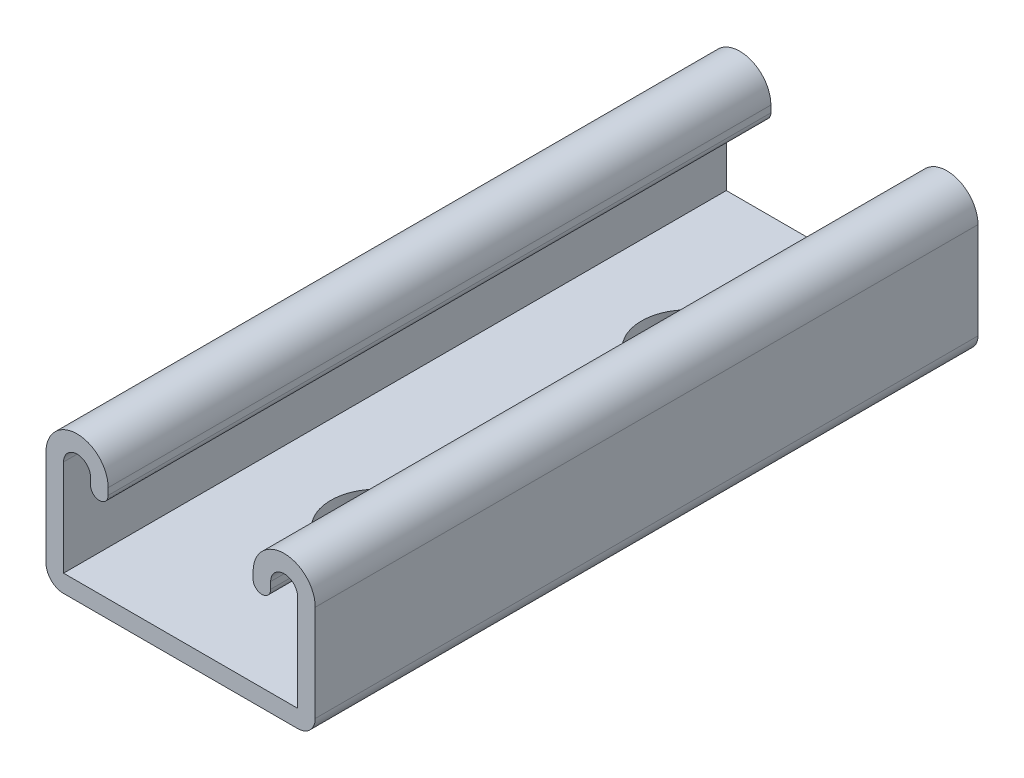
ISO-10303-21;
HEADER;
FILE_DESCRIPTION(('STEP AP214'),'2;1');
FILE_NAME('part.step','',(''),(''),'','','');
FILE_SCHEMA(('AUTOMOTIVE_DESIGN { 1 0 10303 214 1 1 1 1 }'));
ENDSEC;
DATA;
#1=APPLICATION_CONTEXT('core data for automotive mechanical design processes');
#2=APPLICATION_PROTOCOL_DEFINITION('international standard','automotive_design',2000,#1);
#3=PRODUCT_CONTEXT('',#1,'mechanical');
#4=PRODUCT('Part','Part','',(#3));
#5=PRODUCT_RELATED_PRODUCT_CATEGORY('part','',(#4));
#6=PRODUCT_DEFINITION_FORMATION('','',#4);
#7=PRODUCT_DEFINITION_CONTEXT('part definition',#1,'design');
#8=PRODUCT_DEFINITION('design','',#6,#7);
#9=PRODUCT_DEFINITION_SHAPE('','',#8);
#10=(LENGTH_UNIT() NAMED_UNIT(*) SI_UNIT(.MILLI.,.METRE.));
#11=(NAMED_UNIT(*) PLANE_ANGLE_UNIT() SI_UNIT($,.RADIAN.));
#12=(NAMED_UNIT(*) SI_UNIT($,.STERADIAN.) SOLID_ANGLE_UNIT());
#13=UNCERTAINTY_MEASURE_WITH_UNIT(LENGTH_MEASURE(1.E-05),#10,'distance_accuracy_value','');
#14=(GEOMETRIC_REPRESENTATION_CONTEXT(3) GLOBAL_UNCERTAINTY_ASSIGNED_CONTEXT((#13)) GLOBAL_UNIT_ASSIGNED_CONTEXT((#10,
#11,#12)) REPRESENTATION_CONTEXT('',''));
#15=CARTESIAN_POINT('',(0.,0.,0.));
#16=DIRECTION('',(0.,0.,1.));
#17=DIRECTION('',(1.,0.,0.));
#18=AXIS2_PLACEMENT_3D('',#15,#16,#17);
#19=CARTESIAN_POINT('',(-15.875,8.3693,101.6));
#20=DIRECTION('',(0.,0.,-1.));
#21=DIRECTION('',(-1.,0.,0.));
#22=AXIS2_PLACEMENT_3D('',#19,#20,#21);
#23=CYLINDRICAL_SURFACE('',#22,4.7625);
#24=CARTESIAN_POINT('',(-15.875,8.3693,0.));
#25=DIRECTION('',(0.,0.,1.));
#26=DIRECTION('',(-1.,0.,0.));
#27=AXIS2_PLACEMENT_3D('',#24,#25,#26);
#28=CIRCLE('',#27,4.7625);
#29=CARTESIAN_POINT('',(-11.1125,8.3693,0.));
#30=VERTEX_POINT('',#29);
#31=CARTESIAN_POINT('',(-20.6375,8.3693,0.));
#32=VERTEX_POINT('',#31);
#33=EDGE_CURVE('E207',#30,#32,#28,.T.);
#34=ORIENTED_EDGE('',*,*,#33,.T.);
#35=DIRECTION('',(0.,0.,-1.));
#36=VECTOR('',#35,1.);
#37=CARTESIAN_POINT('',(-20.6375,8.3693,101.6));
#38=LINE('',#37,#36);
#39=CARTESIAN_POINT('',(-20.6375,8.3693,101.6));
#40=VERTEX_POINT('',#39);
#41=EDGE_CURVE('E11',#40,#32,#38,.T.);
#42=ORIENTED_EDGE('',*,*,#41,.F.);
#43=CARTESIAN_POINT('',(-15.875,8.3693,101.6));
#44=DIRECTION('',(0.,0.,1.));
#45=DIRECTION('',(-1.,0.,0.));
#46=AXIS2_PLACEMENT_3D('',#43,#44,#45);
#47=CIRCLE('',#46,4.7625);
#48=CARTESIAN_POINT('',(-11.1125,8.3693,101.6));
#49=VERTEX_POINT('',#48);
#50=EDGE_CURVE('E260',#49,#40,#47,.T.);
#51=ORIENTED_EDGE('',*,*,#50,.F.);
#52=DIRECTION('',(0.,0.,-1.));
#53=VECTOR('',#52,1.);
#54=CARTESIAN_POINT('',(-11.1125,8.3693,101.6));
#55=LINE('',#54,#53);
#56=EDGE_CURVE('E204',#49,#30,#55,.T.);
#57=ORIENTED_EDGE('',*,*,#56,.T.);
#58=EDGE_LOOP('',(#34,#42,#51,#57));
#59=FACE_BOUND('',#58,.T.);
#60=ADVANCED_FACE('F41',(#59),#23,.T.);
#61=CARTESIAN_POINT('',(-20.6375,8.3693,101.6));
#62=DIRECTION('',(1.,0.,0.));
#63=DIRECTION('',(0.,1.,0.));
#64=AXIS2_PLACEMENT_3D('',#61,#62,#63);
#65=PLANE('',#64);
#66=DIRECTION('',(0.,-1.,0.));
#67=VECTOR('',#66,1.);
#68=CARTESIAN_POINT('',(-20.6375,8.3693,0.));
#69=LINE('',#68,#67);
#70=CARTESIAN_POINT('',(-20.6375,-6.4008,0.));
#71=VERTEX_POINT('',#70);
#72=EDGE_CURVE('E208',#32,#71,#69,.T.);
#73=ORIENTED_EDGE('',*,*,#72,.T.);
#74=DIRECTION('',(0.,0.,-1.));
#75=VECTOR('',#74,1.);
#76=CARTESIAN_POINT('',(-20.6375,-6.4008,101.6));
#77=LINE('',#76,#75);
#78=CARTESIAN_POINT('',(-20.6375,-6.4008,101.6));
#79=VERTEX_POINT('',#78);
#80=EDGE_CURVE('E51',#79,#71,#77,.T.);
#81=ORIENTED_EDGE('',*,*,#80,.F.);
#82=DIRECTION('',(0.,-1.,0.));
#83=VECTOR('',#82,1.);
#84=CARTESIAN_POINT('',(-20.6375,8.3693,101.6));
#85=LINE('',#84,#83);
#86=EDGE_CURVE('E135',#40,#79,#85,.T.);
#87=ORIENTED_EDGE('',*,*,#86,.F.);
#88=ORIENTED_EDGE('',*,*,#41,.T.);
#89=EDGE_LOOP('',(#73,#81,#87,#88));
#90=FACE_BOUND('',#89,.T.);
#91=ADVANCED_FACE('F431',(#90),#65,.F.);
#92=CARTESIAN_POINT('',(-17.9451,-6.4008,101.6));
#93=DIRECTION('',(0.,0.,-1.));
#94=DIRECTION('',(-1.,0.,0.));
#95=AXIS2_PLACEMENT_3D('',#92,#93,#94);
#96=CYLINDRICAL_SURFACE('',#95,2.6924);
#97=CARTESIAN_POINT('',(-17.9451,-6.4008,0.));
#98=DIRECTION('',(0.,0.,1.));
#99=DIRECTION('',(-1.,0.,0.));
#100=AXIS2_PLACEMENT_3D('',#97,#98,#99);
#101=CIRCLE('',#100,2.6924);
#102=CARTESIAN_POINT('',(-17.9451,-9.0932,0.));
#103=VERTEX_POINT('',#102);
#104=EDGE_CURVE('E212',#71,#103,#101,.T.);
#105=ORIENTED_EDGE('',*,*,#104,.T.);
#106=DIRECTION('',(0.,0.,-1.));
#107=VECTOR('',#106,1.);
#108=CARTESIAN_POINT('',(-17.9451,-9.0932,101.6));
#109=LINE('',#108,#107);
#110=CARTESIAN_POINT('',(-17.9451,-9.0932,101.6));
#111=VERTEX_POINT('',#110);
#112=EDGE_CURVE('E310',#111,#103,#109,.T.);
#113=ORIENTED_EDGE('',*,*,#112,.F.);
#114=CARTESIAN_POINT('',(-17.9451,-6.4008,101.6));
#115=DIRECTION('',(0.,0.,1.));
#116=DIRECTION('',(-1.,0.,0.));
#117=AXIS2_PLACEMENT_3D('',#114,#115,#116);
#118=CIRCLE('',#117,2.6924);
#119=EDGE_CURVE('E318',#79,#111,#118,.T.);
#120=ORIENTED_EDGE('',*,*,#119,.F.);
#121=ORIENTED_EDGE('',*,*,#80,.T.);
#122=EDGE_LOOP('',(#105,#113,#120,#121));
#123=FACE_BOUND('',#122,.T.);
#124=ADVANCED_FACE('F319',(#123),#96,.T.);
#125=CARTESIAN_POINT('',(-17.9451,-9.0932,101.6));
#126=DIRECTION('',(0.,1.,0.));
#127=DIRECTION('',(0.,0.,1.));
#128=AXIS2_PLACEMENT_3D('',#125,#126,#127);
#129=PLANE('',#128);
#130=CARTESIAN_POINT('',(0.,-9.0932,71.4375));
#131=DIRECTION('',(0.,-1.,0.));
#132=DIRECTION('',(0.,0.,-1.));
#133=AXIS2_PLACEMENT_3D('',#130,#131,#132);
#134=CIRCLE('',#133,7.14375);
#135=CARTESIAN_POINT('',(0.,-9.0932,64.29375));
#136=VERTEX_POINT('',#135);
#137=EDGE_CURVE('E619',#136,#136,#134,.T.);
#138=ORIENTED_EDGE('',*,*,#137,.F.);
#139=EDGE_LOOP('',(#138));
#140=FACE_BOUND('',#139,.T.);
#141=CARTESIAN_POINT('',(0.,-9.0932,23.8125));
#142=DIRECTION('',(0.,-1.,0.));
#143=DIRECTION('',(0.,0.,-1.));
#144=AXIS2_PLACEMENT_3D('',#141,#142,#143);
#145=CIRCLE('',#144,7.14375);
#146=CARTESIAN_POINT('',(0.,-9.0932,16.66875));
#147=VERTEX_POINT('',#146);
#148=EDGE_CURVE('E622',#147,#147,#145,.T.);
#149=ORIENTED_EDGE('',*,*,#148,.F.);
#150=EDGE_LOOP('',(#149));
#151=FACE_BOUND('',#150,.T.);
#152=DIRECTION('',(1.,0.,0.));
#153=VECTOR('',#152,1.);
#154=CARTESIAN_POINT('',(-17.9451,-9.0932,0.));
#155=LINE('',#154,#153);
#156=CARTESIAN_POINT('',(17.9451,-9.0932,0.));
#157=VERTEX_POINT('',#156);
#158=EDGE_CURVE('E218',#103,#157,#155,.T.);
#159=ORIENTED_EDGE('',*,*,#158,.T.);
#160=DIRECTION('',(0.,0.,-1.));
#161=VECTOR('',#160,1.);
#162=CARTESIAN_POINT('',(17.9451,-9.0932,101.6));
#163=LINE('',#162,#161);
#164=CARTESIAN_POINT('',(17.9451,-9.0932,101.6));
#165=VERTEX_POINT('',#164);
#166=EDGE_CURVE('E303',#165,#157,#163,.T.);
#167=ORIENTED_EDGE('',*,*,#166,.F.);
#168=DIRECTION('',(1.,0.,0.));
#169=VECTOR('',#168,1.);
#170=CARTESIAN_POINT('',(-17.9451,-9.0932,101.6));
#171=LINE('',#170,#169);
#172=EDGE_CURVE('E339',#111,#165,#171,.T.);
#173=ORIENTED_EDGE('',*,*,#172,.F.);
#174=ORIENTED_EDGE('',*,*,#112,.T.);
#175=EDGE_LOOP('',(#159,#167,#173,#174));
#176=FACE_BOUND('',#175,.T.);
#177=ADVANCED_FACE('F327',(#140,#151,#176),#129,.F.);
#178=CARTESIAN_POINT('',(17.9451,-6.4008,101.6));
#179=DIRECTION('',(0.,0.,-1.));
#180=DIRECTION('',(-1.,0.,0.));
#181=AXIS2_PLACEMENT_3D('',#178,#179,#180);
#182=CYLINDRICAL_SURFACE('',#181,2.6924);
#183=CARTESIAN_POINT('',(17.9451,-6.4008,0.));
#184=DIRECTION('',(0.,0.,1.));
#185=DIRECTION('',(1.,0.,0.));
#186=AXIS2_PLACEMENT_3D('',#183,#184,#185);
#187=CIRCLE('',#186,2.6924);
#188=CARTESIAN_POINT('',(20.6375,-6.4008,0.));
#189=VERTEX_POINT('',#188);
#190=EDGE_CURVE('E217',#157,#189,#187,.T.);
#191=ORIENTED_EDGE('',*,*,#190,.T.);
#192=DIRECTION('',(0.,0.,-1.));
#193=VECTOR('',#192,1.);
#194=CARTESIAN_POINT('',(20.6375,-6.4008,101.6));
#195=LINE('',#194,#193);
#196=CARTESIAN_POINT('',(20.6375,-6.4008,101.6));
#197=VERTEX_POINT('',#196);
#198=EDGE_CURVE('E299',#197,#189,#195,.T.);
#199=ORIENTED_EDGE('',*,*,#198,.F.);
#200=CARTESIAN_POINT('',(17.9451,-6.4008,101.6));
#201=DIRECTION('',(0.,0.,1.));
#202=DIRECTION('',(1.,0.,0.));
#203=AXIS2_PLACEMENT_3D('',#200,#201,#202);
#204=CIRCLE('',#203,2.6924);
#205=EDGE_CURVE('E333',#165,#197,#204,.T.);
#206=ORIENTED_EDGE('',*,*,#205,.F.);
#207=ORIENTED_EDGE('',*,*,#166,.T.);
#208=EDGE_LOOP('',(#191,#199,#206,#207));
#209=FACE_BOUND('',#208,.T.);
#210=ADVANCED_FACE('F335',(#209),#182,.T.);
#211=CARTESIAN_POINT('',(20.6375,-6.4008,101.6));
#212=DIRECTION('',(-1.,0.,0.));
#213=DIRECTION('',(0.,-1.,0.));
#214=AXIS2_PLACEMENT_3D('',#211,#212,#213);
#215=PLANE('',#214);
#216=DIRECTION('',(0.,1.,0.));
#217=VECTOR('',#216,1.);
#218=CARTESIAN_POINT('',(20.6375,-6.4008,0.));
#219=LINE('',#218,#217);
#220=CARTESIAN_POINT('',(20.6375,8.3693,0.));
#221=VERTEX_POINT('',#220);
#222=EDGE_CURVE('E224',#189,#221,#219,.T.);
#223=ORIENTED_EDGE('',*,*,#222,.T.);
#224=DIRECTION('',(0.,0.,-1.));
#225=VECTOR('',#224,1.);
#226=CARTESIAN_POINT('',(20.6375,8.3693,101.6));
#227=LINE('',#226,#225);
#228=CARTESIAN_POINT('',(20.6375,8.3693,101.6));
#229=VERTEX_POINT('',#228);
#230=EDGE_CURVE('E294',#229,#221,#227,.T.);
#231=ORIENTED_EDGE('',*,*,#230,.F.);
#232=DIRECTION('',(0.,1.,0.));
#233=VECTOR('',#232,1.);
#234=CARTESIAN_POINT('',(20.6375,-6.4008,101.6));
#235=LINE('',#234,#233);
#236=EDGE_CURVE('E336',#197,#229,#235,.T.);
#237=ORIENTED_EDGE('',*,*,#236,.F.);
#238=ORIENTED_EDGE('',*,*,#198,.T.);
#239=EDGE_LOOP('',(#223,#231,#237,#238));
#240=FACE_BOUND('',#239,.T.);
#241=ADVANCED_FACE('F444',(#240),#215,.F.);
#242=CARTESIAN_POINT('',(15.875,8.3693,101.6));
#243=DIRECTION('',(0.,0.,-1.));
#244=DIRECTION('',(-1.,0.,0.));
#245=AXIS2_PLACEMENT_3D('',#242,#243,#244);
#246=CYLINDRICAL_SURFACE('',#245,4.7625);
#247=CARTESIAN_POINT('',(15.875,8.3693,0.));
#248=DIRECTION('',(0.,0.,1.));
#249=DIRECTION('',(1.,0.,0.));
#250=AXIS2_PLACEMENT_3D('',#247,#248,#249);
#251=CIRCLE('',#250,4.7625);
#252=CARTESIAN_POINT('',(11.1125,8.3693,0.));
#253=VERTEX_POINT('',#252);
#254=EDGE_CURVE('E223',#221,#253,#251,.T.);
#255=ORIENTED_EDGE('',*,*,#254,.T.);
#256=DIRECTION('',(0.,0.,-1.));
#257=VECTOR('',#256,1.);
#258=CARTESIAN_POINT('',(11.1125,8.3693,101.6));
#259=LINE('',#258,#257);
#260=CARTESIAN_POINT('',(11.1125,8.3693,101.6));
#261=VERTEX_POINT('',#260);
#262=EDGE_CURVE('E293',#261,#253,#259,.T.);
#263=ORIENTED_EDGE('',*,*,#262,.F.);
#264=CARTESIAN_POINT('',(15.875,8.3693,101.6));
#265=DIRECTION('',(0.,0.,1.));
#266=DIRECTION('',(1.,0.,0.));
#267=AXIS2_PLACEMENT_3D('',#264,#265,#266);
#268=CIRCLE('',#267,4.7625);
#269=EDGE_CURVE('E342',#229,#261,#268,.T.);
#270=ORIENTED_EDGE('',*,*,#269,.F.);
#271=ORIENTED_EDGE('',*,*,#230,.T.);
#272=EDGE_LOOP('',(#255,#263,#270,#271));
#273=FACE_BOUND('',#272,.T.);
#274=ADVANCED_FACE('F449',(#273),#246,.T.);
#275=CARTESIAN_POINT('',(11.1125,8.3693,101.6));
#276=DIRECTION('',(1.,0.,0.));
#277=DIRECTION('',(0.,0.,-1.));
#278=AXIS2_PLACEMENT_3D('',#275,#276,#277);
#279=PLANE('',#278);
#280=DIRECTION('',(0.,-1.,0.));
#281=VECTOR('',#280,1.);
#282=CARTESIAN_POINT('',(11.1125,8.3693,0.));
#283=LINE('',#282,#281);
#284=CARTESIAN_POINT('',(11.1125,7.33425,0.));
#285=VERTEX_POINT('',#284);
#286=EDGE_CURVE('E226',#253,#285,#283,.T.);
#287=ORIENTED_EDGE('',*,*,#286,.T.);
#288=DIRECTION('',(0.,0.,-1.));
#289=VECTOR('',#288,1.);
#290=CARTESIAN_POINT('',(11.1125,7.33425,101.6));
#291=LINE('',#290,#289);
#292=CARTESIAN_POINT('',(11.1125,7.33425,101.6));
#293=VERTEX_POINT('',#292);
#294=EDGE_CURVE('E289',#293,#285,#291,.T.);
#295=ORIENTED_EDGE('',*,*,#294,.F.);
#296=DIRECTION('',(0.,-1.,0.));
#297=VECTOR('',#296,1.);
#298=CARTESIAN_POINT('',(11.1125,8.3693,101.6));
#299=LINE('',#298,#297);
#300=EDGE_CURVE('E352',#261,#293,#299,.T.);
#301=ORIENTED_EDGE('',*,*,#300,.F.);
#302=ORIENTED_EDGE('',*,*,#262,.T.);
#303=EDGE_LOOP('',(#287,#295,#301,#302));
#304=FACE_BOUND('',#303,.T.);
#305=ADVANCED_FACE('F455',(#304),#279,.F.);
#306=CARTESIAN_POINT('',(12.4587,7.33425,101.6));
#307=DIRECTION('',(0.,0.,-1.));
#308=DIRECTION('',(-1.,0.,0.));
#309=AXIS2_PLACEMENT_3D('',#306,#307,#308);
#310=CYLINDRICAL_SURFACE('',#309,1.3462);
#311=CARTESIAN_POINT('',(12.4587,7.33425,0.));
#312=DIRECTION('',(0.,0.,1.));
#313=DIRECTION('',(1.,0.,0.));
#314=AXIS2_PLACEMENT_3D('',#311,#312,#313);
#315=CIRCLE('',#314,1.3462);
#316=CARTESIAN_POINT('',(13.8049,7.33425,0.));
#317=VERTEX_POINT('',#316);
#318=EDGE_CURVE('E233',#285,#317,#315,.T.);
#319=ORIENTED_EDGE('',*,*,#318,.T.);
#320=DIRECTION('',(0.,0.,-1.));
#321=VECTOR('',#320,1.);
#322=CARTESIAN_POINT('',(13.8049,7.33425,101.6));
#323=LINE('',#322,#321);
#324=CARTESIAN_POINT('',(13.8049,7.33425,101.6));
#325=VERTEX_POINT('',#324);
#326=EDGE_CURVE('E281',#325,#317,#323,.T.);
#327=ORIENTED_EDGE('',*,*,#326,.F.);
#328=CARTESIAN_POINT('',(12.4587,7.33425,101.6));
#329=DIRECTION('',(0.,0.,1.));
#330=DIRECTION('',(1.,0.,0.));
#331=AXIS2_PLACEMENT_3D('',#328,#329,#330);
#332=CIRCLE('',#331,1.3462);
#333=EDGE_CURVE('E351',#293,#325,#332,.T.);
#334=ORIENTED_EDGE('',*,*,#333,.F.);
#335=ORIENTED_EDGE('',*,*,#294,.T.);
#336=EDGE_LOOP('',(#319,#327,#334,#335));
#337=FACE_BOUND('',#336,.T.);
#338=ADVANCED_FACE('F458',(#337),#310,.T.);
#339=CARTESIAN_POINT('',(13.8049,8.3693,101.6));
#340=DIRECTION('',(-1.,0.,0.));
#341=DIRECTION('',(0.,0.,1.));
#342=AXIS2_PLACEMENT_3D('',#339,#340,#341);
#343=PLANE('',#342);
#344=DIRECTION('',(0.,1.,0.));
#345=VECTOR('',#344,1.);
#346=CARTESIAN_POINT('',(13.8049,8.3693,0.));
#347=LINE('',#346,#345);
#348=CARTESIAN_POINT('',(13.8049,8.3693,0.));
#349=VERTEX_POINT('',#348);
#350=EDGE_CURVE('E234',#317,#349,#347,.T.);
#351=ORIENTED_EDGE('',*,*,#350,.T.);
#352=DIRECTION('',(0.,0.,-1.));
#353=VECTOR('',#352,1.);
#354=CARTESIAN_POINT('',(13.8049,8.3693,101.6));
#355=LINE('',#354,#353);
#356=CARTESIAN_POINT('',(13.8049,8.3693,101.6));
#357=VERTEX_POINT('',#356);
#358=EDGE_CURVE('E278',#357,#349,#355,.T.);
#359=ORIENTED_EDGE('',*,*,#358,.F.);
#360=DIRECTION('',(0.,1.,0.));
#361=VECTOR('',#360,1.);
#362=CARTESIAN_POINT('',(13.8049,8.3693,101.6));
#363=LINE('',#362,#361);
#364=EDGE_CURVE('E357',#325,#357,#363,.T.);
#365=ORIENTED_EDGE('',*,*,#364,.F.);
#366=ORIENTED_EDGE('',*,*,#326,.T.);
#367=EDGE_LOOP('',(#351,#359,#365,#366));
#368=FACE_BOUND('',#367,.T.);
#369=ADVANCED_FACE('F459',(#368),#343,.F.);
#370=CARTESIAN_POINT('',(15.875,8.3693,101.6));
#371=DIRECTION('',(0.,0.,-1.));
#372=DIRECTION('',(-1.,0.,0.));
#373=AXIS2_PLACEMENT_3D('',#370,#371,#372);
#374=CYLINDRICAL_SURFACE('',#373,2.0701);
#375=CARTESIAN_POINT('',(15.875,8.3693,0.));
#376=DIRECTION('',(0.,0.,-1.));
#377=DIRECTION('',(1.,0.,0.));
#378=AXIS2_PLACEMENT_3D('',#375,#376,#377);
#379=CIRCLE('',#378,2.0701);
#380=CARTESIAN_POINT('',(17.9451,8.3693,0.));
#381=VERTEX_POINT('',#380);
#382=EDGE_CURVE('E240',#349,#381,#379,.T.);
#383=ORIENTED_EDGE('',*,*,#382,.T.);
#384=DIRECTION('',(0.,0.,-1.));
#385=VECTOR('',#384,1.);
#386=CARTESIAN_POINT('',(17.9451,8.3693,101.6));
#387=LINE('',#386,#385);
#388=CARTESIAN_POINT('',(17.9451,8.3693,101.6));
#389=VERTEX_POINT('',#388);
#390=EDGE_CURVE('E273',#389,#381,#387,.T.);
#391=ORIENTED_EDGE('',*,*,#390,.F.);
#392=CARTESIAN_POINT('',(15.875,8.3693,101.6));
#393=DIRECTION('',(0.,0.,-1.));
#394=DIRECTION('',(1.,0.,0.));
#395=AXIS2_PLACEMENT_3D('',#392,#393,#394);
#396=CIRCLE('',#395,2.0701);
#397=EDGE_CURVE('E359',#357,#389,#396,.T.);
#398=ORIENTED_EDGE('',*,*,#397,.F.);
#399=ORIENTED_EDGE('',*,*,#358,.T.);
#400=EDGE_LOOP('',(#383,#391,#398,#399));
#401=FACE_BOUND('',#400,.T.);
#402=ADVANCED_FACE('F461',(#401),#374,.F.);
#403=CARTESIAN_POINT('',(17.9451,-6.4008,101.6));
#404=DIRECTION('',(1.,0.,0.));
#405=DIRECTION('',(0.,1.,0.));
#406=AXIS2_PLACEMENT_3D('',#403,#404,#405);
#407=PLANE('',#406);
#408=DIRECTION('',(0.,-1.,0.));
#409=VECTOR('',#408,1.);
#410=CARTESIAN_POINT('',(17.9451,-6.4008,0.));
#411=LINE('',#410,#409);
#412=CARTESIAN_POINT('',(17.9451,-6.4008,0.));
#413=VERTEX_POINT('',#412);
#414=EDGE_CURVE('E239',#381,#413,#411,.T.);
#415=ORIENTED_EDGE('',*,*,#414,.T.);
#416=DIRECTION('',(0.,0.,-1.));
#417=VECTOR('',#416,1.);
#418=CARTESIAN_POINT('',(17.9451,-6.4008,101.6));
#419=LINE('',#418,#417);
#420=CARTESIAN_POINT('',(17.9451,-6.4008,101.6));
#421=VERTEX_POINT('',#420);
#422=EDGE_CURVE('E272',#421,#413,#419,.T.);
#423=ORIENTED_EDGE('',*,*,#422,.F.);
#424=DIRECTION('',(0.,-1.,0.));
#425=VECTOR('',#424,1.);
#426=CARTESIAN_POINT('',(17.9451,-6.4008,101.6));
#427=LINE('',#426,#425);
#428=EDGE_CURVE('E361',#389,#421,#427,.T.);
#429=ORIENTED_EDGE('',*,*,#428,.F.);
#430=ORIENTED_EDGE('',*,*,#390,.T.);
#431=EDGE_LOOP('',(#415,#423,#429,#430));
#432=FACE_BOUND('',#431,.T.);
#433=ADVANCED_FACE('F466',(#432),#407,.F.);
#434=CARTESIAN_POINT('',(-17.9451,-6.4008,101.6));
#435=DIRECTION('',(0.,-1.,0.));
#436=DIRECTION('',(0.,0.,-1.));
#437=AXIS2_PLACEMENT_3D('',#434,#435,#436);
#438=PLANE('',#437);
#439=CARTESIAN_POINT('',(0.,-6.4008,71.4375));
#440=DIRECTION('',(0.,-1.,0.));
#441=DIRECTION('',(0.,0.,-1.));
#442=AXIS2_PLACEMENT_3D('',#439,#440,#441);
#443=CIRCLE('',#442,7.14375);
#444=CARTESIAN_POINT('',(0.,-6.4008,64.29375));
#445=VERTEX_POINT('',#444);
#446=EDGE_CURVE('E621',#445,#445,#443,.T.);
#447=ORIENTED_EDGE('',*,*,#446,.T.);
#448=EDGE_LOOP('',(#447));
#449=FACE_BOUND('',#448,.T.);
#450=CARTESIAN_POINT('',(0.,-6.4008,23.8125));
#451=DIRECTION('',(0.,-1.,0.));
#452=DIRECTION('',(0.,0.,-1.));
#453=AXIS2_PLACEMENT_3D('',#450,#451,#452);
#454=CIRCLE('',#453,7.14375);
#455=CARTESIAN_POINT('',(0.,-6.4008,16.66875));
#456=VERTEX_POINT('',#455);
#457=EDGE_CURVE('E42',#456,#456,#454,.T.);
#458=ORIENTED_EDGE('',*,*,#457,.T.);
#459=EDGE_LOOP('',(#458));
#460=FACE_BOUND('',#459,.T.);
#461=DIRECTION('',(-1.,0.,0.));
#462=VECTOR('',#461,1.);
#463=CARTESIAN_POINT('',(-17.9451,-6.4008,0.));
#464=LINE('',#463,#462);
#465=CARTESIAN_POINT('',(-17.9451,-6.4008,0.));
#466=VERTEX_POINT('',#465);
#467=EDGE_CURVE('E243',#413,#466,#464,.T.);
#468=ORIENTED_EDGE('',*,*,#467,.T.);
#469=DIRECTION('',(0.,0.,-1.));
#470=VECTOR('',#469,1.);
#471=CARTESIAN_POINT('',(-17.9451,-6.4008,101.6));
#472=LINE('',#471,#470);
#473=CARTESIAN_POINT('',(-17.9451,-6.4008,101.6));
#474=VERTEX_POINT('',#473);
#475=EDGE_CURVE('E269',#474,#466,#472,.T.);
#476=ORIENTED_EDGE('',*,*,#475,.F.);
#477=DIRECTION('',(-1.,0.,0.));
#478=VECTOR('',#477,1.);
#479=CARTESIAN_POINT('',(-17.9451,-6.4008,101.6));
#480=LINE('',#479,#478);
#481=EDGE_CURVE('E366',#421,#474,#480,.T.);
#482=ORIENTED_EDGE('',*,*,#481,.F.);
#483=ORIENTED_EDGE('',*,*,#422,.T.);
#484=EDGE_LOOP('',(#468,#476,#482,#483));
#485=FACE_BOUND('',#484,.T.);
#486=ADVANCED_FACE('F475',(#449,#460,#485),#438,.F.);
#487=CARTESIAN_POINT('',(-17.9451,8.3693,101.6));
#488=DIRECTION('',(-1.,0.,0.));
#489=DIRECTION('',(0.,-1.,0.));
#490=AXIS2_PLACEMENT_3D('',#487,#488,#489);
#491=PLANE('',#490);
#492=DIRECTION('',(0.,1.,0.));
#493=VECTOR('',#492,1.);
#494=CARTESIAN_POINT('',(-17.9451,8.3693,0.));
#495=LINE('',#494,#493);
#496=CARTESIAN_POINT('',(-17.9451,8.3693,0.));
#497=VERTEX_POINT('',#496);
#498=EDGE_CURVE('E246',#466,#497,#495,.T.);
#499=ORIENTED_EDGE('',*,*,#498,.T.);
#500=DIRECTION('',(0.,0.,-1.));
#501=VECTOR('',#500,1.);
#502=CARTESIAN_POINT('',(-17.9451,8.3693,101.6));
#503=LINE('',#502,#501);
#504=CARTESIAN_POINT('',(-17.9451,8.3693,101.6));
#505=VERTEX_POINT('',#504);
#506=EDGE_CURVE('E261',#505,#497,#503,.T.);
#507=ORIENTED_EDGE('',*,*,#506,.F.);
#508=DIRECTION('',(0.,1.,0.));
#509=VECTOR('',#508,1.);
#510=CARTESIAN_POINT('',(-17.9451,8.3693,101.6));
#511=LINE('',#510,#509);
#512=EDGE_CURVE('E367',#474,#505,#511,.T.);
#513=ORIENTED_EDGE('',*,*,#512,.F.);
#514=ORIENTED_EDGE('',*,*,#475,.T.);
#515=EDGE_LOOP('',(#499,#507,#513,#514));
#516=FACE_BOUND('',#515,.T.);
#517=ADVANCED_FACE('F415',(#516),#491,.F.);
#518=CARTESIAN_POINT('',(-15.875,8.3693,101.6));
#519=DIRECTION('',(0.,0.,-1.));
#520=DIRECTION('',(-1.,0.,0.));
#521=AXIS2_PLACEMENT_3D('',#518,#519,#520);
#522=CYLINDRICAL_SURFACE('',#521,2.0701);
#523=CARTESIAN_POINT('',(-15.875,8.3693,0.));
#524=DIRECTION('',(0.,0.,-1.));
#525=DIRECTION('',(-1.,0.,0.));
#526=AXIS2_PLACEMENT_3D('',#523,#524,#525);
#527=CIRCLE('',#526,2.0701);
#528=CARTESIAN_POINT('',(-13.8049,8.3693,0.));
#529=VERTEX_POINT('',#528);
#530=EDGE_CURVE('E248',#497,#529,#527,.T.);
#531=ORIENTED_EDGE('',*,*,#530,.T.);
#532=DIRECTION('',(0.,0.,-1.));
#533=VECTOR('',#532,1.);
#534=CARTESIAN_POINT('',(-13.8049,8.3693,101.6));
#535=LINE('',#534,#533);
#536=CARTESIAN_POINT('',(-13.8049,8.3693,101.6));
#537=VERTEX_POINT('',#536);
#538=EDGE_CURVE('E195',#537,#529,#535,.T.);
#539=ORIENTED_EDGE('',*,*,#538,.F.);
#540=CARTESIAN_POINT('',(-15.875,8.3693,101.6));
#541=DIRECTION('',(0.,0.,-1.));
#542=DIRECTION('',(-1.,0.,0.));
#543=AXIS2_PLACEMENT_3D('',#540,#541,#542);
#544=CIRCLE('',#543,2.0701);
#545=EDGE_CURVE('E181',#505,#537,#544,.T.);
#546=ORIENTED_EDGE('',*,*,#545,.F.);
#547=ORIENTED_EDGE('',*,*,#506,.T.);
#548=EDGE_LOOP('',(#531,#539,#546,#547));
#549=FACE_BOUND('',#548,.T.);
#550=ADVANCED_FACE('F417',(#549),#522,.F.);
#551=CARTESIAN_POINT('',(-13.8049,8.3693,101.6));
#552=DIRECTION('',(1.,0.,0.));
#553=DIRECTION('',(0.,1.,0.));
#554=AXIS2_PLACEMENT_3D('',#551,#552,#553);
#555=PLANE('',#554);
#556=DIRECTION('',(0.,-1.,0.));
#557=VECTOR('',#556,1.);
#558=CARTESIAN_POINT('',(-13.8049,8.3693,0.));
#559=LINE('',#558,#557);
#560=CARTESIAN_POINT('',(-13.8049,7.33425,0.));
#561=VERTEX_POINT('',#560);
#562=EDGE_CURVE('E188',#529,#561,#559,.T.);
#563=ORIENTED_EDGE('',*,*,#562,.T.);
#564=DIRECTION('',(0.,0.,-1.));
#565=VECTOR('',#564,1.);
#566=CARTESIAN_POINT('',(-13.8049,7.33425,101.6));
#567=LINE('',#566,#565);
#568=CARTESIAN_POINT('',(-13.8049,7.33425,101.6));
#569=VERTEX_POINT('',#568);
#570=EDGE_CURVE('E190',#569,#561,#567,.T.);
#571=ORIENTED_EDGE('',*,*,#570,.F.);
#572=DIRECTION('',(0.,-1.,0.));
#573=VECTOR('',#572,1.);
#574=CARTESIAN_POINT('',(-13.8049,8.3693,101.6));
#575=LINE('',#574,#573);
#576=EDGE_CURVE('E174',#537,#569,#575,.T.);
#577=ORIENTED_EDGE('',*,*,#576,.F.);
#578=ORIENTED_EDGE('',*,*,#538,.T.);
#579=EDGE_LOOP('',(#563,#571,#577,#578));
#580=FACE_BOUND('',#579,.T.);
#581=ADVANCED_FACE('F189',(#580),#555,.F.);
#582=CARTESIAN_POINT('',(-12.4587,7.33425,101.6));
#583=DIRECTION('',(0.,0.,-1.));
#584=DIRECTION('',(-1.,0.,0.));
#585=AXIS2_PLACEMENT_3D('',#582,#583,#584);
#586=CYLINDRICAL_SURFACE('',#585,1.3462);
#587=CARTESIAN_POINT('',(-12.4587,7.33425,0.));
#588=DIRECTION('',(0.,0.,1.));
#589=DIRECTION('',(-1.,0.,0.));
#590=AXIS2_PLACEMENT_3D('',#587,#588,#589);
#591=CIRCLE('',#590,1.3462);
#592=CARTESIAN_POINT('',(-11.1125,7.33425,0.));
#593=VERTEX_POINT('',#592);
#594=EDGE_CURVE('E117',#561,#593,#591,.T.);
#595=ORIENTED_EDGE('',*,*,#594,.T.);
#596=DIRECTION('',(0.,0.,-1.));
#597=VECTOR('',#596,1.);
#598=CARTESIAN_POINT('',(-11.1125,7.33425,101.6));
#599=LINE('',#598,#597);
#600=CARTESIAN_POINT('',(-11.1125,7.33425,101.6));
#601=VERTEX_POINT('',#600);
#602=EDGE_CURVE('E192',#601,#593,#599,.T.);
#603=ORIENTED_EDGE('',*,*,#602,.F.);
#604=CARTESIAN_POINT('',(-12.4587,7.33425,101.6));
#605=DIRECTION('',(0.,0.,1.));
#606=DIRECTION('',(-1.,0.,0.));
#607=AXIS2_PLACEMENT_3D('',#604,#605,#606);
#608=CIRCLE('',#607,1.3462);
#609=EDGE_CURVE('E177',#569,#601,#608,.T.);
#610=ORIENTED_EDGE('',*,*,#609,.F.);
#611=ORIENTED_EDGE('',*,*,#570,.T.);
#612=EDGE_LOOP('',(#595,#603,#610,#611));
#613=FACE_BOUND('',#612,.T.);
#614=ADVANCED_FACE('F194',(#613),#586,.T.);
#615=CARTESIAN_POINT('',(-11.1125,8.3693,101.6));
#616=DIRECTION('',(-1.,0.,0.));
#617=DIRECTION('',(0.,0.,1.));
#618=AXIS2_PLACEMENT_3D('',#615,#616,#617);
#619=PLANE('',#618);
#620=DIRECTION('',(0.,1.,0.));
#621=VECTOR('',#620,1.);
#622=CARTESIAN_POINT('',(-11.1125,8.3693,0.));
#623=LINE('',#622,#621);
#624=EDGE_CURVE('E121',#593,#30,#623,.T.);
#625=ORIENTED_EDGE('',*,*,#624,.T.);
#626=ORIENTED_EDGE('',*,*,#56,.F.);
#627=DIRECTION('',(0.,1.,0.));
#628=VECTOR('',#627,1.);
#629=CARTESIAN_POINT('',(-11.1125,8.3693,101.6));
#630=LINE('',#629,#628);
#631=EDGE_CURVE('E56',#601,#49,#630,.T.);
#632=ORIENTED_EDGE('',*,*,#631,.F.);
#633=ORIENTED_EDGE('',*,*,#602,.T.);
#634=EDGE_LOOP('',(#625,#626,#632,#633));
#635=FACE_BOUND('',#634,.T.);
#636=ADVANCED_FACE('F418',(#635),#619,.F.);
#637=CARTESIAN_POINT('',(-15.875,8.3693,101.6));
#638=DIRECTION('',(0.,0.,-1.));
#639=DIRECTION('',(-1.,0.,0.));
#640=AXIS2_PLACEMENT_3D('',#637,#638,#639);
#641=PLANE('',#640);
#642=ORIENTED_EDGE('',*,*,#50,.T.);
#643=ORIENTED_EDGE('',*,*,#86,.T.);
#644=ORIENTED_EDGE('',*,*,#119,.T.);
#645=ORIENTED_EDGE('',*,*,#172,.T.);
#646=ORIENTED_EDGE('',*,*,#205,.T.);
#647=ORIENTED_EDGE('',*,*,#236,.T.);
#648=ORIENTED_EDGE('',*,*,#269,.T.);
#649=ORIENTED_EDGE('',*,*,#300,.T.);
#650=ORIENTED_EDGE('',*,*,#333,.T.);
#651=ORIENTED_EDGE('',*,*,#364,.T.);
#652=ORIENTED_EDGE('',*,*,#397,.T.);
#653=ORIENTED_EDGE('',*,*,#428,.T.);
#654=ORIENTED_EDGE('',*,*,#481,.T.);
#655=ORIENTED_EDGE('',*,*,#512,.T.);
#656=ORIENTED_EDGE('',*,*,#545,.T.);
#657=ORIENTED_EDGE('',*,*,#576,.T.);
#658=ORIENTED_EDGE('',*,*,#609,.T.);
#659=ORIENTED_EDGE('',*,*,#631,.T.);
#660=EDGE_LOOP('',(#642,#643,#644,#645,#646,#647,#648,#649,#650,#651,#652,#653,#654,#655,#656,
#657,#658,#659));
#661=FACE_BOUND('',#660,.T.);
#662=ADVANCED_FACE('F180',(#661),#641,.F.);
#663=CARTESIAN_POINT('',(-15.875,8.3693,0.));
#664=DIRECTION('',(0.,0.,-1.));
#665=DIRECTION('',(-1.,0.,0.));
#666=AXIS2_PLACEMENT_3D('',#663,#664,#665);
#667=PLANE('',#666);
#668=ORIENTED_EDGE('',*,*,#33,.F.);
#669=ORIENTED_EDGE('',*,*,#624,.F.);
#670=ORIENTED_EDGE('',*,*,#594,.F.);
#671=ORIENTED_EDGE('',*,*,#562,.F.);
#672=ORIENTED_EDGE('',*,*,#530,.F.);
#673=ORIENTED_EDGE('',*,*,#498,.F.);
#674=ORIENTED_EDGE('',*,*,#467,.F.);
#675=ORIENTED_EDGE('',*,*,#414,.F.);
#676=ORIENTED_EDGE('',*,*,#382,.F.);
#677=ORIENTED_EDGE('',*,*,#350,.F.);
#678=ORIENTED_EDGE('',*,*,#318,.F.);
#679=ORIENTED_EDGE('',*,*,#286,.F.);
#680=ORIENTED_EDGE('',*,*,#254,.F.);
#681=ORIENTED_EDGE('',*,*,#222,.F.);
#682=ORIENTED_EDGE('',*,*,#190,.F.);
#683=ORIENTED_EDGE('',*,*,#158,.F.);
#684=ORIENTED_EDGE('',*,*,#104,.F.);
#685=ORIENTED_EDGE('',*,*,#72,.F.);
#686=EDGE_LOOP('',(#668,#669,#670,#671,#672,#673,#674,#675,#676,#677,#678,#679,#680,#681,#682,
#683,#684,#685));
#687=FACE_BOUND('',#686,.T.);
#688=ADVANCED_FACE('F323',(#687),#667,.T.);
#689=CARTESIAN_POINT('',(0.,13.1318,23.8125));
#690=DIRECTION('',(0.,-1.,0.));
#691=DIRECTION('',(0.,0.,-1.));
#692=AXIS2_PLACEMENT_3D('',#689,#690,#691);
#693=CYLINDRICAL_SURFACE('',#692,7.14375);
#694=ORIENTED_EDGE('',*,*,#148,.T.);
#695=EDGE_LOOP('',(#694));
#696=FACE_BOUND('',#695,.T.);
#697=ORIENTED_EDGE('',*,*,#457,.F.);
#698=EDGE_LOOP('',(#697));
#699=FACE_BOUND('',#698,.T.);
#700=ADVANCED_FACE('F512',(#696,#699),#693,.F.);
#701=CARTESIAN_POINT('',(0.,13.1318,71.4375));
#702=DIRECTION('',(0.,-1.,0.));
#703=DIRECTION('',(0.,0.,-1.));
#704=AXIS2_PLACEMENT_3D('',#701,#702,#703);
#705=CYLINDRICAL_SURFACE('',#704,7.14375);
#706=ORIENTED_EDGE('',*,*,#137,.T.);
#707=EDGE_LOOP('',(#706));
#708=FACE_BOUND('',#707,.T.);
#709=ORIENTED_EDGE('',*,*,#446,.F.);
#710=EDGE_LOOP('',(#709));
#711=FACE_BOUND('',#710,.T.);
#712=ADVANCED_FACE('F518',(#708,#711),#705,.F.);
#713=CLOSED_SHELL('',(#60,#91,#124,#177,#210,#241,#274,#305,#338,#369,#402,#433,#486,#517,#550,
#581,#614,#636,#662,#688,#700,#712));
#714=MANIFOLD_SOLID_BREP('B2',#713);
#715=ADVANCED_BREP_SHAPE_REPRESENTATION('',(#18,#714),#14);
#716=SHAPE_DEFINITION_REPRESENTATION(#9,#715);
ENDSEC;
END-ISO-10303-21;
